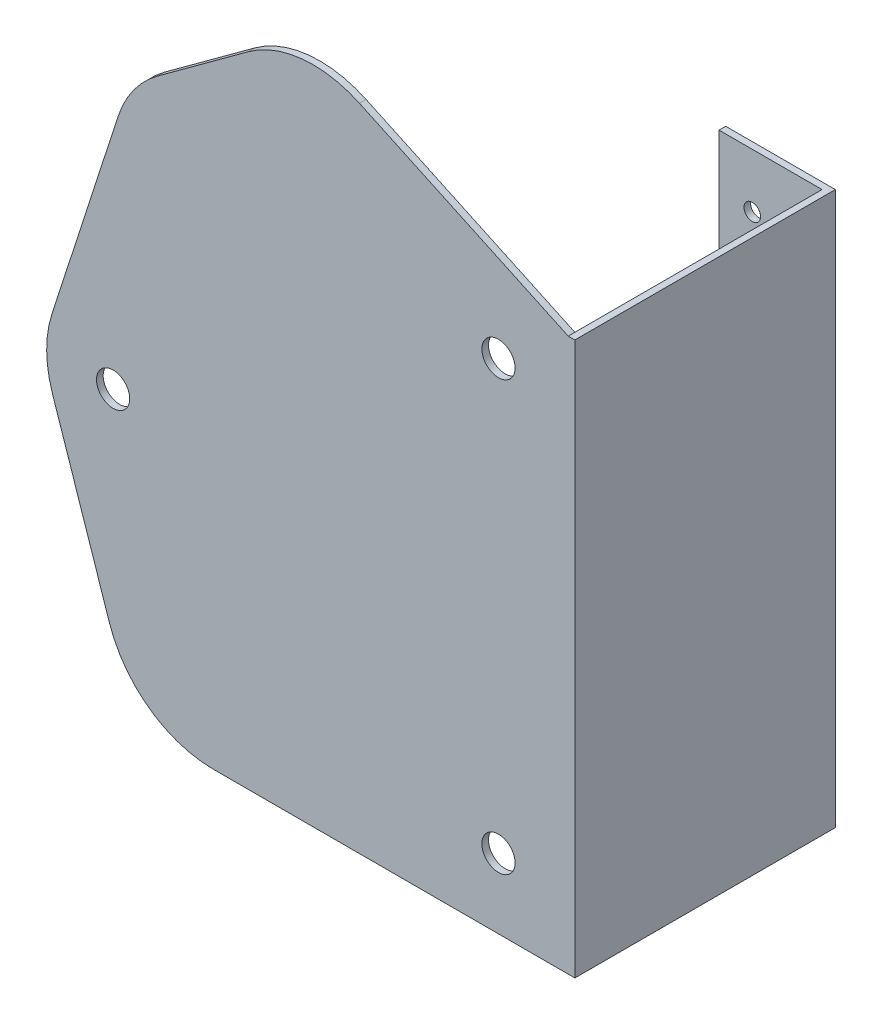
from build123d import *

# Parameters (mm, degrees)
BOSS_EXTRU_1_DEPTH      = 2
ESQUISSE2_R             = 5
ENL_V_MAT_EXTRU_1_DEPTH = 254.248277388
ESQUISSE3_W             = 2
ESQUISSE3_H             = 166.333882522
BOSS_EXTRU_2_DEPTH      = 78.4
ESQUISSE4_W             = 2
ESQUISSE4_H             = 166.333882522
BOSS_EXTRU_3_DEPTH      = 31
ESQUISSE8_R             = 2.5
ENL_V_MAT_EXTRU_3_DEPTH = 265.513988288


with BuildPart() as part:
    # Esquisse1 → Boss.-Extru.1 (new body)
    with BuildSketch(Plane.XY):
        with BuildLine():
            Line((0, 0), (0, 145.3))
            Line((0, 145.3), (0, 166.333882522))
            Line((0, 166.333882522), (-19.067217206, 175.214504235))
            Line((-19.067217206, 175.214504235), (-62.867217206, 195.614504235))
            ThreePointArc((-62.867217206, 195.614504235), (-80.035316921, 198.541021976), (-96.302316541, 192.320662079))
            Line((-96.302316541, 192.320662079), (-123.602316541, 172.320662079))
            ThreePointArc((-123.602316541, 172.320662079), (-130.842987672, 165.034234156), (-135.492379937, 155.874403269))
            Line((-135.492379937, 155.874403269), (-155.392379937, 94.474403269))
            ThreePointArc((-155.392379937, 94.474403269), (-156.999580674, 84.133640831), (-155.288203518, 73.809608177))
            Line((-155.288203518, 73.809608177), (-138.088203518, 22.509608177))
            ThreePointArc((-138.088203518, 22.509608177), (-126.071962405, 6.212102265), (-106.8, 0))
            Line((-106.8, 0), (0, 0))
        make_face()
    extrude(amount=BOSS_EXTRU_1_DEPTH)

    # Esquisse2 → Enl_v. mat.-Extru.1 (cut, through all)
    with BuildSketch(Plane.XY.offset(2)):
        with Locations((-21, 21)):
            Circle(ESQUISSE2_R)
        with Locations((-21, 150)):
            Circle(ESQUISSE2_R)
        with Locations((-137, 84)):
            Circle(ESQUISSE2_R)
    extrude(amount=-ENL_V_MAT_EXTRU_1_DEPTH, mode=Mode.SUBTRACT)

    # Esquisse3 → Boss.-Extru.2 (add)
    with BuildSketch(Plane.XY.offset(2)):
        with Locations((1, 83.166941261)):
            Rectangle(ESQUISSE3_W, ESQUISSE3_H)
    extrude(amount=-BOSS_EXTRU_2_DEPTH)

    # Esquisse4 → Boss.-Extru.3 (add)
    with BuildSketch(Plane.ZY):
        with Locations((-75.4, 83.166941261)):
            Rectangle(ESQUISSE4_W, ESQUISSE4_H)
    extrude(amount=BOSS_EXTRU_3_DEPTH)

    # Esquisse8 → Enl_v. mat.-Extru.3 (cut, through all)
    with BuildSketch(Plane.XY.offset(-74.4)):
        with Locations((-21, 21)):
            Circle(ESQUISSE8_R)
        with Locations((-21, 150)):
            Circle(ESQUISSE8_R)
    extrude(amount=-ENL_V_MAT_EXTRU_3_DEPTH, mode=Mode.SUBTRACT)


solid = part.part
